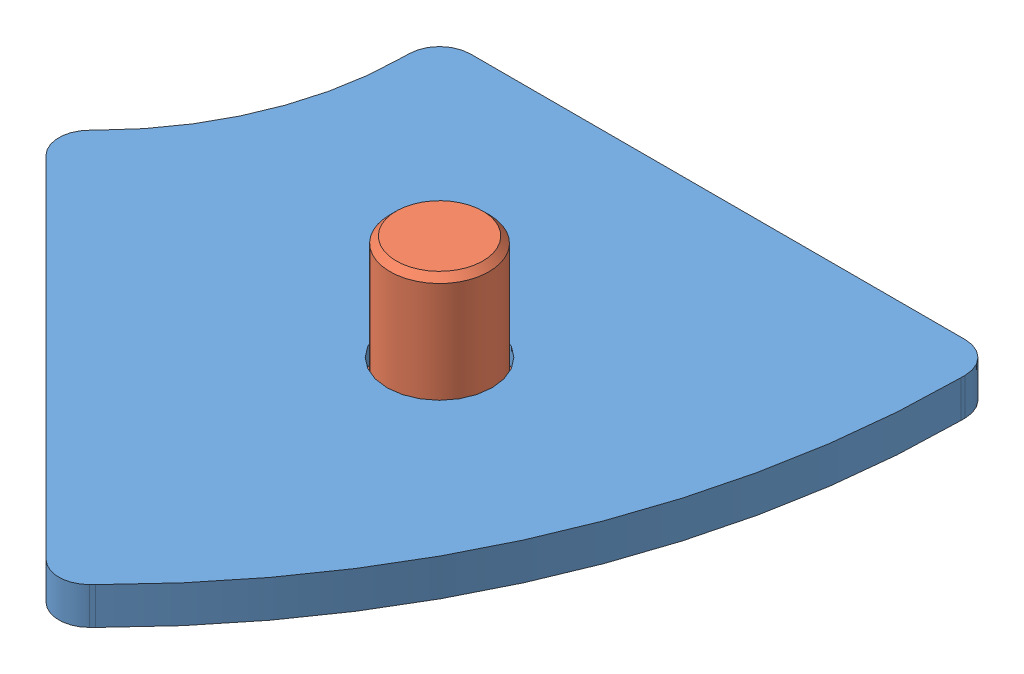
SolidWorks assembly 22.1017_2 END CAP 45 R 45 DEG ALU.SLDASM, configuration Default (file format 6000). Lengths in mm.
Overall size (53.28 11.5 53.28).
2 component instances, 2 part files, 2 mates.
Components (placement in the parent):
- 22.1017_2 END CAP 45 R 45 DEG ALU-1: 22.1017_2 END CAP 45 R 45 DEG ALU.SLDPRT [Default] at origin size (53.28 3 53.28)
- 21.1666 M8x10 Stainless-1: 21.1666 M8x10 Stainless.SLDPRT [Default] at (22.5 -3 22.5) x (0.18485 0 -0.982767) z (0 -1 0) size (12 12 11.5)
Mates (geometry in assembly coordinates):
- Concentric1: concentric: cylinder of 22.1017_2 END CAP 45 R 45 DEG ALU-1 through (22.5 -1.5 22.5) axis (0 1 0) radius 4.25; cylinder of 21.1666 M8x10 Stainless-1 through (22.5 -41.4631 22.5) axis (0 1 0) radius 4
- Coincident1: coincident anti-aligned: plane of 22.1017_2 END CAP 45 R 45 DEG ALU-1 through (22.5 -1.5 22.5) normal (0 -1 0); plane of 21.1666 M8x10 Stainless-1 through (22.5 -1.5 22.5) normal (0 1 0)
